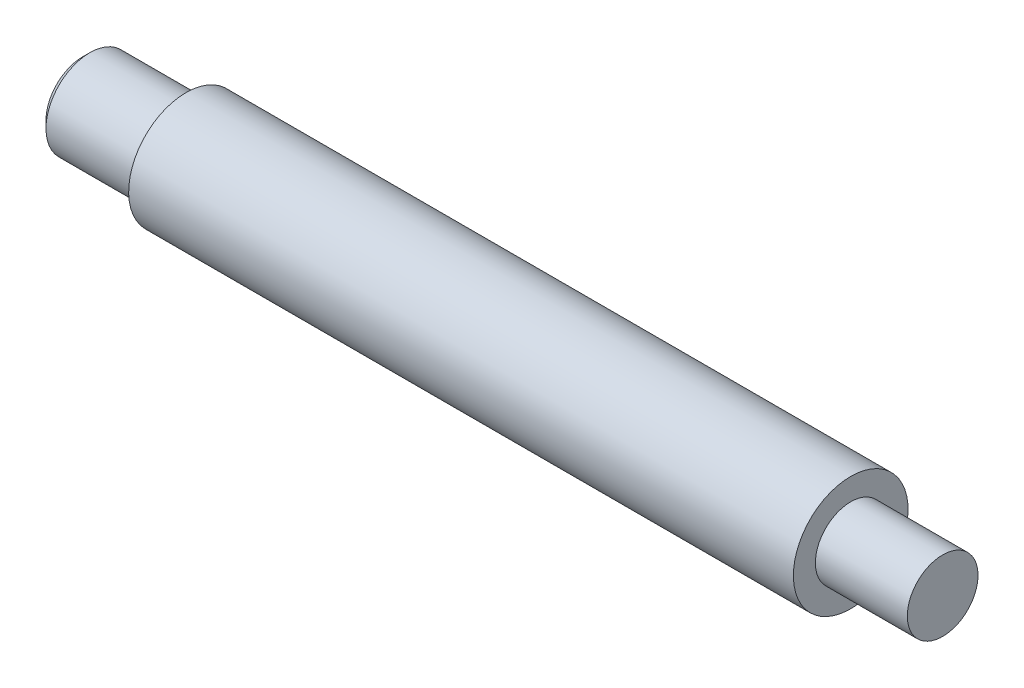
ISO-10303-21;
HEADER;
FILE_DESCRIPTION(('STEP AP214'),'2;1');
FILE_NAME('part.step','',(''),(''),'','','');
FILE_SCHEMA(('AUTOMOTIVE_DESIGN { 1 0 10303 214 1 1 1 1 }'));
ENDSEC;
DATA;
#1=APPLICATION_CONTEXT('core data for automotive mechanical design processes');
#2=APPLICATION_PROTOCOL_DEFINITION('international standard','automotive_design',2000,#1);
#3=PRODUCT_CONTEXT('',#1,'mechanical');
#4=PRODUCT('Part','Part','',(#3));
#5=PRODUCT_RELATED_PRODUCT_CATEGORY('part','',(#4));
#6=PRODUCT_DEFINITION_FORMATION('','',#4);
#7=PRODUCT_DEFINITION_CONTEXT('part definition',#1,'design');
#8=PRODUCT_DEFINITION('design','',#6,#7);
#9=PRODUCT_DEFINITION_SHAPE('','',#8);
#10=(LENGTH_UNIT() NAMED_UNIT(*) SI_UNIT(.MILLI.,.METRE.));
#11=(NAMED_UNIT(*) PLANE_ANGLE_UNIT() SI_UNIT($,.RADIAN.));
#12=(NAMED_UNIT(*) SI_UNIT($,.STERADIAN.) SOLID_ANGLE_UNIT());
#13=UNCERTAINTY_MEASURE_WITH_UNIT(LENGTH_MEASURE(1.E-05),#10,'distance_accuracy_value','');
#14=(GEOMETRIC_REPRESENTATION_CONTEXT(3) GLOBAL_UNCERTAINTY_ASSIGNED_CONTEXT((#13)) GLOBAL_UNIT_ASSIGNED_CONTEXT((#10,
#11,#12)) REPRESENTATION_CONTEXT('',''));
#15=CARTESIAN_POINT('',(0.,0.,0.));
#16=DIRECTION('',(0.,0.,1.));
#17=DIRECTION('',(1.,0.,0.));
#18=AXIS2_PLACEMENT_3D('',#15,#16,#17);
#19=CARTESIAN_POINT('',(60.8,0.,0.));
#20=DIRECTION('',(-1.,0.,0.));
#21=DIRECTION('',(0.,-1.,0.));
#22=AXIS2_PLACEMENT_3D('',#19,#20,#21);
#23=PLANE('',#22);
#24=CARTESIAN_POINT('',(60.8,0.,0.));
#25=DIRECTION('',(1.,0.,0.));
#26=DIRECTION('',(0.,1.,0.));
#27=AXIS2_PLACEMENT_3D('',#24,#25,#26);
#28=CIRCLE('',#27,2.5);
#29=CARTESIAN_POINT('',(60.8,2.5,0.));
#30=VERTEX_POINT('',#29);
#31=EDGE_CURVE('E10',#30,#30,#28,.T.);
#32=ORIENTED_EDGE('',*,*,#31,.T.);
#33=EDGE_LOOP('',(#32));
#34=FACE_BOUND('',#33,.T.);
#35=ADVANCED_FACE('F30',(#34),#23,.F.);
#36=CARTESIAN_POINT('',(60.8,0.,0.));
#37=DIRECTION('',(1.,0.,0.));
#38=DIRECTION('',(0.,1.,0.));
#39=AXIS2_PLACEMENT_3D('',#36,#37,#38);
#40=CYLINDRICAL_SURFACE('',#39,2.5);
#41=ORIENTED_EDGE('',*,*,#31,.F.);
#42=EDGE_LOOP('',(#41));
#43=FACE_BOUND('',#42,.T.);
#44=CARTESIAN_POINT('',(54.3,0.,0.));
#45=DIRECTION('',(1.,0.,0.));
#46=DIRECTION('',(0.,1.,0.));
#47=AXIS2_PLACEMENT_3D('',#44,#45,#46);
#48=CIRCLE('',#47,2.5);
#49=CARTESIAN_POINT('',(54.3,2.5,0.));
#50=VERTEX_POINT('',#49);
#51=EDGE_CURVE('E36',#50,#50,#48,.T.);
#52=ORIENTED_EDGE('',*,*,#51,.T.);
#53=EDGE_LOOP('',(#52));
#54=FACE_BOUND('',#53,.T.);
#55=ADVANCED_FACE('F71',(#43,#54),#40,.T.);
#56=CARTESIAN_POINT('',(54.3,-2.5,0.));
#57=DIRECTION('',(-1.,0.,0.));
#58=DIRECTION('',(0.,-1.,0.));
#59=AXIS2_PLACEMENT_3D('',#56,#57,#58);
#60=PLANE('',#59);
#61=ORIENTED_EDGE('',*,*,#51,.F.);
#62=EDGE_LOOP('',(#61));
#63=FACE_BOUND('',#62,.T.);
#64=CARTESIAN_POINT('',(54.3,0.,0.));
#65=DIRECTION('',(1.,0.,0.));
#66=DIRECTION('',(0.,1.,0.));
#67=AXIS2_PLACEMENT_3D('',#64,#65,#66);
#68=CIRCLE('',#67,4.05500000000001);
#69=CARTESIAN_POINT('',(54.3,4.05500000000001,0.));
#70=VERTEX_POINT('',#69);
#71=EDGE_CURVE('E40',#70,#70,#68,.T.);
#72=ORIENTED_EDGE('',*,*,#71,.T.);
#73=EDGE_LOOP('',(#72));
#74=FACE_BOUND('',#73,.T.);
#75=ADVANCED_FACE('F75',(#63,#74),#60,.F.);
#76=CARTESIAN_POINT('',(60.8,0.,0.));
#77=DIRECTION('',(1.,0.,0.));
#78=DIRECTION('',(0.,1.,0.));
#79=AXIS2_PLACEMENT_3D('',#76,#77,#78);
#80=CYLINDRICAL_SURFACE('',#79,4.055);
#81=ORIENTED_EDGE('',*,*,#71,.F.);
#82=EDGE_LOOP('',(#81));
#83=FACE_BOUND('',#82,.T.);
#84=CARTESIAN_POINT('',(7.3,0.,0.));
#85=DIRECTION('',(1.,0.,0.));
#86=DIRECTION('',(0.,1.,0.));
#87=AXIS2_PLACEMENT_3D('',#84,#85,#86);
#88=CIRCLE('',#87,4.055);
#89=CARTESIAN_POINT('',(7.3,4.055,0.));
#90=VERTEX_POINT('',#89);
#91=EDGE_CURVE('E44',#90,#90,#88,.T.);
#92=ORIENTED_EDGE('',*,*,#91,.T.);
#93=EDGE_LOOP('',(#92));
#94=FACE_BOUND('',#93,.T.);
#95=ADVANCED_FACE('F80',(#83,#94),#80,.T.);
#96=CARTESIAN_POINT('',(7.3,-4.055,0.));
#97=DIRECTION('',(1.,0.,0.));
#98=DIRECTION('',(0.,1.,0.));
#99=AXIS2_PLACEMENT_3D('',#96,#97,#98);
#100=PLANE('',#99);
#101=ORIENTED_EDGE('',*,*,#91,.F.);
#102=EDGE_LOOP('',(#101));
#103=FACE_BOUND('',#102,.T.);
#104=CARTESIAN_POINT('',(7.3,0.,0.));
#105=DIRECTION('',(1.,0.,0.));
#106=DIRECTION('',(0.,1.,0.));
#107=AXIS2_PLACEMENT_3D('',#104,#105,#106);
#108=CIRCLE('',#107,3.1);
#109=CARTESIAN_POINT('',(7.3,3.1,0.));
#110=VERTEX_POINT('',#109);
#111=EDGE_CURVE('E49',#110,#110,#108,.T.);
#112=ORIENTED_EDGE('',*,*,#111,.T.);
#113=EDGE_LOOP('',(#112));
#114=FACE_BOUND('',#113,.T.);
#115=ADVANCED_FACE('F86',(#103,#114),#100,.F.);
#116=CARTESIAN_POINT('',(60.8,0.,0.));
#117=DIRECTION('',(1.,0.,0.));
#118=DIRECTION('',(0.,1.,0.));
#119=AXIS2_PLACEMENT_3D('',#116,#117,#118);
#120=CYLINDRICAL_SURFACE('',#119,3.1);
#121=ORIENTED_EDGE('',*,*,#111,.F.);
#122=EDGE_LOOP('',(#121));
#123=FACE_BOUND('',#122,.T.);
#124=CARTESIAN_POINT('',(0.5,0.,0.));
#125=DIRECTION('',(1.,0.,0.));
#126=DIRECTION('',(0.,1.,0.));
#127=AXIS2_PLACEMENT_3D('',#124,#125,#126);
#128=CIRCLE('',#127,3.1);
#129=CARTESIAN_POINT('',(0.5,3.1,0.));
#130=VERTEX_POINT('',#129);
#131=EDGE_CURVE('E52',#130,#130,#128,.T.);
#132=ORIENTED_EDGE('',*,*,#131,.T.);
#133=EDGE_LOOP('',(#132));
#134=FACE_BOUND('',#133,.T.);
#135=ADVANCED_FACE('F67',(#123,#134),#120,.T.);
#136=CARTESIAN_POINT('',(0.,0.,0.));
#137=DIRECTION('',(1.,0.,0.));
#138=DIRECTION('',(0.,1.,0.));
#139=AXIS2_PLACEMENT_3D('',#136,#137,#138);
#140=CONICAL_SURFACE('',#139,2.6,0.785398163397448);
#141=ORIENTED_EDGE('',*,*,#131,.F.);
#142=EDGE_LOOP('',(#141));
#143=FACE_BOUND('',#142,.T.);
#144=CARTESIAN_POINT('',(0.,0.,0.));
#145=DIRECTION('',(1.,0.,0.));
#146=DIRECTION('',(0.,1.,0.));
#147=AXIS2_PLACEMENT_3D('',#144,#145,#146);
#148=CIRCLE('',#147,2.6);
#149=CARTESIAN_POINT('',(0.,2.6,0.));
#150=VERTEX_POINT('',#149);
#151=EDGE_CURVE('E55',#150,#150,#148,.T.);
#152=ORIENTED_EDGE('',*,*,#151,.T.);
#153=EDGE_LOOP('',(#152));
#154=FACE_BOUND('',#153,.T.);
#155=ADVANCED_FACE('F59',(#143,#154),#140,.T.);
#156=CARTESIAN_POINT('',(0.,-2.6,0.));
#157=DIRECTION('',(1.,0.,0.));
#158=DIRECTION('',(0.,1.,0.));
#159=AXIS2_PLACEMENT_3D('',#156,#157,#158);
#160=PLANE('',#159);
#161=ORIENTED_EDGE('',*,*,#151,.F.);
#162=EDGE_LOOP('',(#161));
#163=FACE_BOUND('',#162,.T.);
#164=ADVANCED_FACE('F61',(#163),#160,.F.);
#165=CLOSED_SHELL('',(#35,#55,#75,#95,#115,#135,#155,#164));
#166=MANIFOLD_SOLID_BREP('B2',#165);
#167=ADVANCED_BREP_SHAPE_REPRESENTATION('',(#18,#166),#14);
#168=SHAPE_DEFINITION_REPRESENTATION(#9,#167);
ENDSEC;
END-ISO-10303-21;
